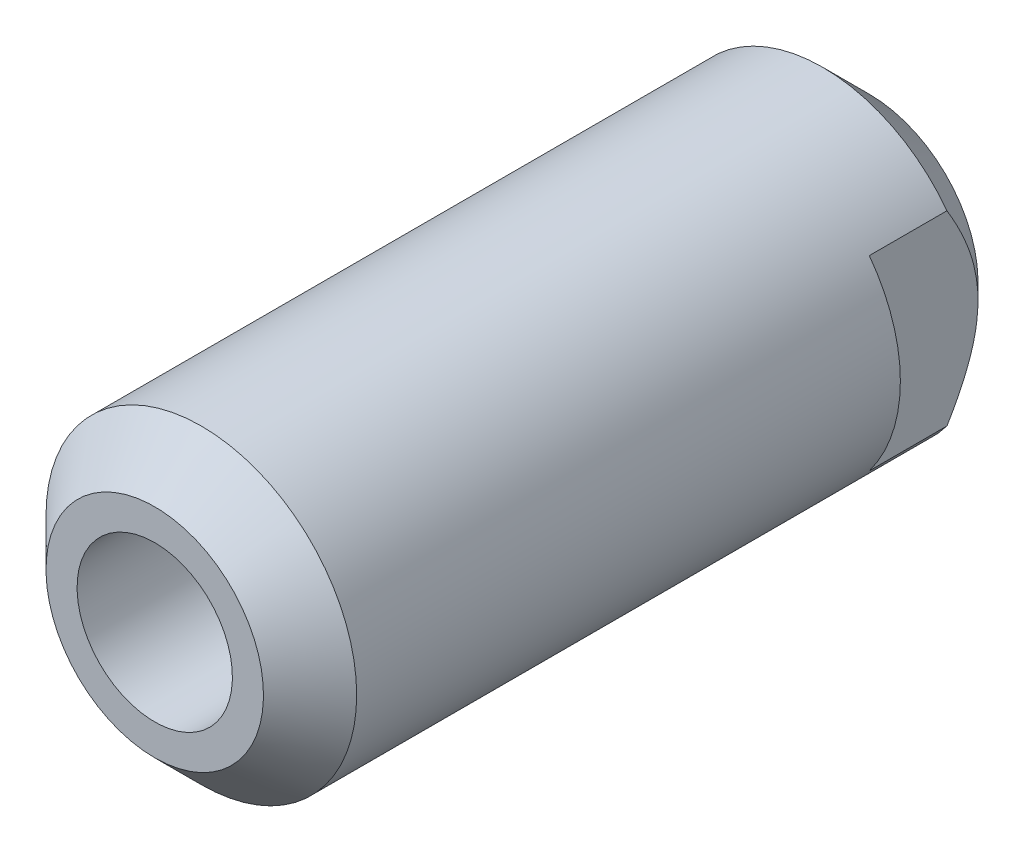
ISO-10303-21;
HEADER;
FILE_DESCRIPTION(('STEP AP214'),'2;1');
FILE_NAME('part.step','',(''),(''),'','','');
FILE_SCHEMA(('AUTOMOTIVE_DESIGN { 1 0 10303 214 1 1 1 1 }'));
ENDSEC;
DATA;
#1=APPLICATION_CONTEXT('core data for automotive mechanical design processes');
#2=APPLICATION_PROTOCOL_DEFINITION('international standard','automotive_design',2000,#1);
#3=PRODUCT_CONTEXT('',#1,'mechanical');
#4=PRODUCT('Part','Part','',(#3));
#5=PRODUCT_RELATED_PRODUCT_CATEGORY('part','',(#4));
#6=PRODUCT_DEFINITION_FORMATION('','',#4);
#7=PRODUCT_DEFINITION_CONTEXT('part definition',#1,'design');
#8=PRODUCT_DEFINITION('design','',#6,#7);
#9=PRODUCT_DEFINITION_SHAPE('','',#8);
#10=(LENGTH_UNIT() NAMED_UNIT(*) SI_UNIT(.MILLI.,.METRE.));
#11=(NAMED_UNIT(*) PLANE_ANGLE_UNIT() SI_UNIT($,.RADIAN.));
#12=(NAMED_UNIT(*) SI_UNIT($,.STERADIAN.) SOLID_ANGLE_UNIT());
#13=UNCERTAINTY_MEASURE_WITH_UNIT(LENGTH_MEASURE(1.E-05),#10,'distance_accuracy_value','');
#14=(GEOMETRIC_REPRESENTATION_CONTEXT(3) GLOBAL_UNCERTAINTY_ASSIGNED_CONTEXT((#13)) GLOBAL_UNIT_ASSIGNED_CONTEXT((#10,
#11,#12)) REPRESENTATION_CONTEXT('',''));
#15=CARTESIAN_POINT('',(0.,0.,0.));
#16=DIRECTION('',(0.,0.,1.));
#17=DIRECTION('',(1.,0.,0.));
#18=AXIS2_PLACEMENT_3D('',#15,#16,#17);
#19=CARTESIAN_POINT('',(-4.00000000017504,-3.03599999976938,4.));
#20=DIRECTION('',(0.,0.,1.));
#21=DIRECTION('',(5.76549803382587E-11,1.,0.));
#22=AXIS2_PLACEMENT_3D('',#19,#20,#21);
#23=PLANE('',#22);
#24=DIRECTION('',(-5.76549803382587E-11,-1.,0.));
#25=VECTOR('',#24,1.);
#26=CARTESIAN_POINT('',(-4.,2.30619921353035E-10,4.));
#27=LINE('',#26,#25);
#28=CARTESIAN_POINT('',(-3.99999999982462,3.00000000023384,4.));
#29=VERTEX_POINT('',#28);
#30=CARTESIAN_POINT('',(-3.99999999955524,-3.00000000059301,4.));
#31=VERTEX_POINT('',#30);
#32=EDGE_CURVE('E54',#29,#31,#27,.T.);
#33=ORIENTED_EDGE('',*,*,#32,.T.);
#34=CARTESIAN_POINT('',(0.,0.,4.));
#35=DIRECTION('',(0.,0.,1.));
#36=DIRECTION('',(-1.,5.76549803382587E-11,0.));
#37=AXIS2_PLACEMENT_3D('',#34,#35,#36);
#38=CIRCLE('',#37,5.);
#39=EDGE_CURVE('E18',#29,#31,#38,.T.);
#40=ORIENTED_EDGE('',*,*,#39,.F.);
#41=EDGE_LOOP('',(#33,#40));
#42=FACE_BOUND('',#41,.T.);
#43=ADVANCED_FACE('F14',(#42),#23,.F.);
#44=CARTESIAN_POINT('',(5.04836367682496,-3.03600000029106,4.));
#45=DIRECTION('',(0.,0.,1.));
#46=DIRECTION('',(5.76549803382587E-11,1.,0.));
#47=AXIS2_PLACEMENT_3D('',#44,#45,#46);
#48=PLANE('',#47);
#49=DIRECTION('',(5.76549803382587E-11,1.,0.));
#50=VECTOR('',#49,1.);
#51=CARTESIAN_POINT('',(4.,-2.30619921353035E-10,4.));
#52=LINE('',#51,#50);
#53=CARTESIAN_POINT('',(4.00000000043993,-2.99999999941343,4.));
#54=VERTEX_POINT('',#53);
#55=CARTESIAN_POINT('',(4.00000000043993,2.99999999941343,4.));
#56=VERTEX_POINT('',#55);
#57=EDGE_CURVE('E71',#54,#56,#52,.T.);
#58=ORIENTED_EDGE('',*,*,#57,.T.);
#59=CARTESIAN_POINT('',(0.,0.,4.));
#60=DIRECTION('',(0.,0.,1.));
#61=DIRECTION('',(-1.,5.76549803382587E-11,0.));
#62=AXIS2_PLACEMENT_3D('',#59,#60,#61);
#63=CIRCLE('',#62,5.);
#64=EDGE_CURVE('E147',#54,#56,#63,.T.);
#65=ORIENTED_EDGE('',*,*,#64,.F.);
#66=EDGE_LOOP('',(#58,#65));
#67=FACE_BOUND('',#66,.T.);
#68=ADVANCED_FACE('F138',(#67),#48,.F.);
#69=CARTESIAN_POINT('',(-4.00000000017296,-2.99999999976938,0.451604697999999));
#70=DIRECTION('',(1.,-5.76549803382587E-11,0.));
#71=DIRECTION('',(5.76549803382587E-11,1.,0.));
#72=AXIS2_PLACEMENT_3D('',#69,#70,#71);
#73=PLANE('',#72);
#74=CARTESIAN_POINT('',(-4.00000000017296,-3.00000000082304,1.5000000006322));
#75=CARTESIAN_POINT('',(-4.00000000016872,-2.92639584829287,1.45584224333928));
#76=CARTESIAN_POINT('',(-4.00000000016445,-2.85233776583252,1.41244232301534));
#77=CARTESIAN_POINT('',(-4.00000000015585,-2.70320881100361,1.32737788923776));
#78=CARTESIAN_POINT('',(-4.00000000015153,-2.6281376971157,1.28571379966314));
#79=CARTESIAN_POINT('',(-4.00000000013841,-2.40073048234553,1.16337968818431));
#80=CARTESIAN_POINT('',(-4.00000000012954,-2.24675491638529,1.08570477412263));
#81=CARTESIAN_POINT('',(-4.00000000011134,-1.93107831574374,0.939497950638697));
#82=CARTESIAN_POINT('',(-4.00000000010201,-1.76928792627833,0.871156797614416));
#83=CARTESIAN_POINT('',(-4.00000000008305,-1.44053681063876,0.748760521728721));
#84=CARTESIAN_POINT('',(-4.00000000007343,-1.2735844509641,0.694683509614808));
#85=CARTESIAN_POINT('',(-4.00000000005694,-0.987583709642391,0.618577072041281));
#86=CARTESIAN_POINT('',(-4.00000000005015,-0.869797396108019,0.591811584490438));
#87=CARTESIAN_POINT('',(-4.00000000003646,-0.632396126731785,0.548003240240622));
#88=CARTESIAN_POINT('',(-4.00000000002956,-0.512781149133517,0.530960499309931));
#89=CARTESIAN_POINT('',(-4.00000000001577,-0.273570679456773,0.507593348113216));
#90=CARTESIAN_POINT('',(-4.00000000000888,-0.153984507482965,0.501174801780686));
#91=CARTESIAN_POINT('',(-3.99999999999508,0.0852774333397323,0.499120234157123));
#92=CARTESIAN_POINT('',(-3.99999999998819,0.204953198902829,0.503483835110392));
#93=CARTESIAN_POINT('',(-3.99999999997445,0.443220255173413,0.522731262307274));
#94=CARTESIAN_POINT('',(-3.99999999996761,0.561813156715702,0.537595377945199));
#95=CARTESIAN_POINT('',(-3.99999999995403,0.79734505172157,0.577040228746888));
#96=CARTESIAN_POINT('',(-3.99999999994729,0.914283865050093,0.601622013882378));
#97=CARTESIAN_POINT('',(-3.99999999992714,1.26369629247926,0.68877334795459));
#98=CARTESIAN_POINT('',(-3.99999999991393,1.49292300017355,0.76457165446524));
#99=CARTESIAN_POINT('',(-3.99999999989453,1.82934366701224,0.897244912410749));
#100=CARTESIAN_POINT('',(-3.99999999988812,1.94049628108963,0.944764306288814));
#101=CARTESIAN_POINT('',(-3.99999999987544,2.16043613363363,1.04509924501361));
#102=CARTESIAN_POINT('',(-3.99999999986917,2.26922294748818,1.09791573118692));
#103=CARTESIAN_POINT('',(-3.99999999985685,2.48281501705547,1.2070218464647));
#104=CARTESIAN_POINT('',(-3.99999999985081,2.58765615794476,1.26324207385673));
#105=CARTESIAN_POINT('',(-3.99999999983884,2.79528919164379,1.37916947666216));
#106=CARTESIAN_POINT('',(-3.99999999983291,2.89808262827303,1.4388738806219));
#107=CARTESIAN_POINT('',(-3.99999999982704,3.0000000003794,1.50000000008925));
#108=B_SPLINE_CURVE_WITH_KNOTS('',3,(#74,#75,#76,#77,#78,#79,#80,#81,#82,#83,#84,#85,#86,#87,
#88,#89,#90,#91,#92,#93,#94,#95,#96,#97,#98,#99,#100,#101,#102,#103,#104,#105,#106,#107),
.UNSPECIFIED.,.F.,.F.,(4,2,2,2,2,2,2,2,2,2,2,2,2,2,2,2,4),(0.,0.257493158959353,
0.515048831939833,1.03210439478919,1.55851091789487,2.08410487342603,2.4461226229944,
2.80814468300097,3.16694151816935,3.52572578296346,3.88383835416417,4.24198962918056,
4.96378621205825,5.326369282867,5.68901690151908,6.04584037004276,6.40238377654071),.UNSPECIFIED.);
#109=CARTESIAN_POINT('',(-3.99999999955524,-3.00000000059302,1.5));
#110=VERTEX_POINT('',#109);
#111=CARTESIAN_POINT('',(-3.99999999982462,3.00000000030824,1.5000000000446));
#112=VERTEX_POINT('',#111);
#113=EDGE_CURVE('E70',#110,#112,#108,.T.);
#114=ORIENTED_EDGE('',*,*,#113,.F.);
#115=DIRECTION('',(0.,0.,-1.));
#116=VECTOR('',#115,1.);
#117=CARTESIAN_POINT('',(-3.99999999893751,-3.00000000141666,11.5));
#118=LINE('',#117,#116);
#119=EDGE_CURVE('E63',#31,#110,#118,.T.);
#120=ORIENTED_EDGE('',*,*,#119,.F.);
#121=ORIENTED_EDGE('',*,*,#32,.F.);
#122=DIRECTION('',(0.,0.,1.));
#123=VECTOR('',#122,1.);
#124=CARTESIAN_POINT('',(-3.9999999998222,3.00000000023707,11.5));
#125=LINE('',#124,#123);
#126=EDGE_CURVE('E65',#112,#29,#125,.T.);
#127=ORIENTED_EDGE('',*,*,#126,.F.);
#128=EDGE_LOOP('',(#114,#120,#121,#127));
#129=FACE_BOUND('',#128,.T.);
#130=ADVANCED_FACE('F68',(#129),#73,.F.);
#131=CARTESIAN_POINT('',(4.00000000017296,2.99999999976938,0.451604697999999));
#132=DIRECTION('',(-1.,5.76549803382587E-11,0.));
#133=DIRECTION('',(-5.76549803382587E-11,-1.,0.));
#134=AXIS2_PLACEMENT_3D('',#131,#132,#133);
#135=PLANE('',#134);
#136=CARTESIAN_POINT('',(4.00000000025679,2.99999999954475,1.49999999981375));
#137=CARTESIAN_POINT('',(4.00000000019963,2.92639584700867,1.45584224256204));
#138=CARTESIAN_POINT('',(4.00000000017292,2.85233776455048,1.41244232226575));
#139=CARTESIAN_POINT('',(4.00000000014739,2.70320880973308,1.32737788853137));
#140=CARTESIAN_POINT('',(4.00000000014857,2.62813769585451,1.28571379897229));
#141=CARTESIAN_POINT('',(4.00000000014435,2.40073048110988,1.16337968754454));
#142=CARTESIAN_POINT('',(4.00000000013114,2.24675491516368,1.08570477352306));
#143=CARTESIAN_POINT('',(4.0000000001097,1.93107831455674,0.939497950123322));
#144=CARTESIAN_POINT('',(4.00000000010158,1.76928792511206,0.871156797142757));
#145=CARTESIAN_POINT('',(4.00000000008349,1.44053680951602,0.748760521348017));
#146=CARTESIAN_POINT('',(4.00000000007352,1.27358444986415,0.694683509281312));
#147=CARTESIAN_POINT('',(4.00000000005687,0.987583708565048,0.618577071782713));
#148=CARTESIAN_POINT('',(4.00000000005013,0.869797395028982,0.591811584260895));
#149=CARTESIAN_POINT('',(4.00000000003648,0.63239612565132,0.548003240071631));
#150=CARTESIAN_POINT('',(4.00000000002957,0.512781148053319,0.530960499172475));
#151=CARTESIAN_POINT('',(4.00000000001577,0.273570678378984,0.507593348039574));
#152=CARTESIAN_POINT('',(4.00000000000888,0.153984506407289,0.50117480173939));
#153=CARTESIAN_POINT('',(3.99999999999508,-0.0852774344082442,0.499120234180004));
#154=CARTESIAN_POINT('',(3.99999999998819,-0.204953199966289,0.503483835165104));
#155=CARTESIAN_POINT('',(3.99999999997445,-0.443220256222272,0.522731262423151));
#156=CARTESIAN_POINT('',(3.99999999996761,-0.561813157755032,0.537595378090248));
#157=CARTESIAN_POINT('',(3.99999999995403,-0.797345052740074,0.577040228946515));
#158=CARTESIAN_POINT('',(3.99999999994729,-0.914283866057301,0.60162201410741));
#159=CARTESIAN_POINT('',(3.99999999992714,-1.26369629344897,0.688773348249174));
#160=CARTESIAN_POINT('',(3.99999999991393,-1.49292300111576,0.76457165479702));
#161=CARTESIAN_POINT('',(3.99999999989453,-1.82934366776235,0.897244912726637));
#162=CARTESIAN_POINT('',(3.99999999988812,-1.94049628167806,0.944764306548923));
#163=CARTESIAN_POINT('',(3.99999999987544,-2.16043613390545,1.04509924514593));
#164=CARTESIAN_POINT('',(3.99999999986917,-2.26922294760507,1.09791573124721));
#165=CARTESIAN_POINT('',(3.99999999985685,-2.48281501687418,1.20702184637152));
#166=CARTESIAN_POINT('',(3.99999999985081,-2.58765615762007,1.2632420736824));
#167=CARTESIAN_POINT('',(3.99999999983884,-2.79528919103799,1.37916947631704));
#168=CARTESIAN_POINT('',(3.99999999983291,-2.89808262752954,1.43887388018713));
#169=CARTESIAN_POINT('',(3.99999999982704,-2.99999999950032,1.4999999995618));
#170=B_SPLINE_CURVE_WITH_KNOTS('',3,(#136,#137,#138,#139,#140,#141,#142,#143,#144,#145,#146,
#147,#148,#149,#150,#151,#152,#153,#154,#155,#156,#157,#158,#159,#160,#161,#162,#163,#164,#165,
#166,#167,#168,#169),.UNSPECIFIED.,.F.,.F.,(4,2,2,2,2,2,2,2,2,2,2,2,2,2,2,2,4),(0.,
0.257493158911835,0.515048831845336,1.03210439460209,1.55851091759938,2.08410487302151,
2.44612262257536,2.80814468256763,3.16694151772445,3.525725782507,3.88383835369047,
4.24198962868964,4.96378621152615,5.32636928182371,5.68901689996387,6.04584036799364,
6.40238377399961),.UNSPECIFIED.);
#171=CARTESIAN_POINT('',(4.00000000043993,2.99999999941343,1.5));
#172=VERTEX_POINT('',#171);
#173=CARTESIAN_POINT('',(4.00000000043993,-2.9999999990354,1.49999999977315));
#174=VERTEX_POINT('',#173);
#175=EDGE_CURVE('E33',#172,#174,#170,.T.);
#176=ORIENTED_EDGE('',*,*,#175,.F.);
#177=DIRECTION('',(0.,0.,-1.));
#178=VECTOR('',#177,1.);
#179=CARTESIAN_POINT('',(4.00000000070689,2.99999999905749,11.5));
#180=LINE('',#179,#178);
#181=EDGE_CURVE('E81',#56,#172,#180,.T.);
#182=ORIENTED_EDGE('',*,*,#181,.F.);
#183=ORIENTED_EDGE('',*,*,#57,.F.);
#184=DIRECTION('',(0.,0.,1.));
#185=VECTOR('',#184,1.);
#186=CARTESIAN_POINT('',(4.00000000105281,-2.99999999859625,11.5));
#187=LINE('',#186,#185);
#188=EDGE_CURVE('E74',#174,#54,#187,.T.);
#189=ORIENTED_EDGE('',*,*,#188,.F.);
#190=EDGE_LOOP('',(#176,#182,#183,#189));
#191=FACE_BOUND('',#190,.T.);
#192=ADVANCED_FACE('F109',(#191),#135,.F.);
#193=CARTESIAN_POINT('',(0.,0.,1.5));
#194=DIRECTION('',(0.,0.,1.));
#195=DIRECTION('',(-1.,5.76549803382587E-11,0.));
#196=AXIS2_PLACEMENT_3D('',#193,#194,#195);
#197=CYLINDRICAL_SURFACE('',#196,5.);
#198=ORIENTED_EDGE('',*,*,#119,.T.);
#199=CARTESIAN_POINT('',(0.,0.,1.5));
#200=DIRECTION('',(0.,0.,1.));
#201=DIRECTION('',(5.76549803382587E-11,1.,0.));
#202=AXIS2_PLACEMENT_3D('',#199,#200,#201);
#203=CIRCLE('',#202,5.);
#204=EDGE_CURVE('E91',#174,#110,#203,.F.);
#205=ORIENTED_EDGE('',*,*,#204,.F.);
#206=ORIENTED_EDGE('',*,*,#188,.T.);
#207=ORIENTED_EDGE('',*,*,#64,.T.);
#208=ORIENTED_EDGE('',*,*,#181,.T.);
#209=CARTESIAN_POINT('',(0.,0.,1.5));
#210=DIRECTION('',(0.,0.,1.));
#211=DIRECTION('',(5.76549803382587E-11,1.,0.));
#212=AXIS2_PLACEMENT_3D('',#209,#210,#211);
#213=CIRCLE('',#212,5.);
#214=EDGE_CURVE('E99',#112,#172,#213,.F.);
#215=ORIENTED_EDGE('',*,*,#214,.F.);
#216=ORIENTED_EDGE('',*,*,#126,.T.);
#217=ORIENTED_EDGE('',*,*,#39,.T.);
#218=EDGE_LOOP('',(#198,#205,#206,#207,#208,#215,#216,#217));
#219=FACE_BOUND('',#218,.T.);
#220=CARTESIAN_POINT('',(0.,0.,21.5));
#221=DIRECTION('',(0.,0.,-1.));
#222=DIRECTION('',(-5.76549803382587E-11,-1.,0.));
#223=AXIS2_PLACEMENT_3D('',#220,#221,#222);
#224=CIRCLE('',#223,5.);
#225=CARTESIAN_POINT('',(-2.88274901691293E-10,-5.,21.5000000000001));
#226=VERTEX_POINT('',#225);
#227=EDGE_CURVE('E79',#226,#226,#224,.F.);
#228=ORIENTED_EDGE('',*,*,#227,.F.);
#229=EDGE_LOOP('',(#228));
#230=FACE_BOUND('',#229,.T.);
#231=ADVANCED_FACE('F60',(#219,#230),#197,.T.);
#232=CARTESIAN_POINT('',(0.,0.,23.));
#233=DIRECTION('',(0.,0.,-1.));
#234=DIRECTION('',(-5.76549803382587E-11,-1.,0.));
#235=AXIS2_PLACEMENT_3D('',#232,#233,#234);
#236=CONICAL_SURFACE('',#235,3.5,0.785398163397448);
#237=ORIENTED_EDGE('',*,*,#227,.T.);
#238=EDGE_LOOP('',(#237));
#239=FACE_BOUND('',#238,.T.);
#240=CARTESIAN_POINT('',(0.,0.,23.));
#241=DIRECTION('',(0.,0.,-1.));
#242=DIRECTION('',(-5.76549803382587E-11,-1.,0.));
#243=AXIS2_PLACEMENT_3D('',#240,#241,#242);
#244=CIRCLE('',#243,3.5);
#245=CARTESIAN_POINT('',(-2.01792431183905E-10,-3.5,23.));
#246=VERTEX_POINT('',#245);
#247=EDGE_CURVE('E88',#246,#246,#244,.F.);
#248=ORIENTED_EDGE('',*,*,#247,.F.);
#249=EDGE_LOOP('',(#248));
#250=FACE_BOUND('',#249,.T.);
#251=ADVANCED_FACE('F126',(#239,#250),#236,.T.);
#252=CARTESIAN_POINT('',(0.,0.,0.));
#253=DIRECTION('',(0.,0.,1.));
#254=DIRECTION('',(5.76549803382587E-11,1.,0.));
#255=AXIS2_PLACEMENT_3D('',#252,#253,#254);
#256=CONICAL_SURFACE('',#255,3.5,0.785398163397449);
#257=CARTESIAN_POINT('',(0.,0.,0.));
#258=DIRECTION('',(0.,0.,1.));
#259=DIRECTION('',(5.76549803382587E-11,1.,0.));
#260=AXIS2_PLACEMENT_3D('',#257,#258,#259);
#261=CIRCLE('',#260,3.5);
#262=CARTESIAN_POINT('',(2.01792431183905E-10,3.5,0.));
#263=VERTEX_POINT('',#262);
#264=EDGE_CURVE('E85',#263,#263,#261,.F.);
#265=ORIENTED_EDGE('',*,*,#264,.F.);
#266=EDGE_LOOP('',(#265));
#267=FACE_BOUND('',#266,.T.);
#268=ORIENTED_EDGE('',*,*,#175,.T.);
#269=ORIENTED_EDGE('',*,*,#204,.T.);
#270=ORIENTED_EDGE('',*,*,#113,.T.);
#271=ORIENTED_EDGE('',*,*,#214,.T.);
#272=EDGE_LOOP('',(#268,#269,#270,#271));
#273=FACE_BOUND('',#272,.T.);
#274=ADVANCED_FACE('F105',(#267,#273),#256,.T.);
#275=CARTESIAN_POINT('',(3.55418791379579,-3.54200000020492,23.));
#276=DIRECTION('',(0.,0.,1.));
#277=DIRECTION('',(5.76549803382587E-11,1.,0.));
#278=AXIS2_PLACEMENT_3D('',#275,#276,#277);
#279=PLANE('',#278);
#280=CARTESIAN_POINT('',(0.,0.,23.));
#281=DIRECTION('',(0.,0.,1.));
#282=DIRECTION('',(5.76549803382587E-11,1.,0.));
#283=AXIS2_PLACEMENT_3D('',#280,#281,#282);
#284=CIRCLE('',#283,2.5);
#285=CARTESIAN_POINT('',(1.44137450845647E-10,2.5,23.));
#286=VERTEX_POINT('',#285);
#287=EDGE_CURVE('E24',#286,#286,#284,.F.);
#288=ORIENTED_EDGE('',*,*,#287,.T.);
#289=EDGE_LOOP('',(#288));
#290=FACE_BOUND('',#289,.T.);
#291=ORIENTED_EDGE('',*,*,#247,.T.);
#292=EDGE_LOOP('',(#291));
#293=FACE_BOUND('',#292,.T.);
#294=ADVANCED_FACE('F115',(#290,#293),#279,.T.);
#295=CARTESIAN_POINT('',(3.55418791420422,3.54199999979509,0.));
#296=DIRECTION('',(0.,0.,-1.));
#297=DIRECTION('',(-5.76549803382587E-11,-1.,0.));
#298=AXIS2_PLACEMENT_3D('',#295,#296,#297);
#299=PLANE('',#298);
#300=CARTESIAN_POINT('',(0.,0.,0.));
#301=DIRECTION('',(0.,0.,1.));
#302=DIRECTION('',(5.76549803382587E-11,1.,0.));
#303=AXIS2_PLACEMENT_3D('',#300,#301,#302);
#304=CIRCLE('',#303,2.5);
#305=CARTESIAN_POINT('',(1.44137450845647E-10,2.5,0.));
#306=VERTEX_POINT('',#305);
#307=EDGE_CURVE('E9',#306,#306,#304,.T.);
#308=ORIENTED_EDGE('',*,*,#307,.T.);
#309=EDGE_LOOP('',(#308));
#310=FACE_BOUND('',#309,.T.);
#311=ORIENTED_EDGE('',*,*,#264,.T.);
#312=EDGE_LOOP('',(#311));
#313=FACE_BOUND('',#312,.T.);
#314=ADVANCED_FACE('F16',(#310,#313),#299,.T.);
#315=CARTESIAN_POINT('',(0.,0.,0.));
#316=DIRECTION('',(0.,0.,1.));
#317=DIRECTION('',(5.76549803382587E-11,1.,0.));
#318=AXIS2_PLACEMENT_3D('',#315,#316,#317);
#319=CYLINDRICAL_SURFACE('',#318,2.5);
#320=ORIENTED_EDGE('',*,*,#287,.F.);
#321=EDGE_LOOP('',(#320));
#322=FACE_BOUND('',#321,.T.);
#323=ORIENTED_EDGE('',*,*,#307,.F.);
#324=EDGE_LOOP('',(#323));
#325=FACE_BOUND('',#324,.T.);
#326=ADVANCED_FACE('F124',(#322,#325),#319,.F.);
#327=CLOSED_SHELL('',(#43,#68,#130,#192,#231,#251,#274,#294,#314,#326));
#328=MANIFOLD_SOLID_BREP('B1',#327);
#329=ADVANCED_BREP_SHAPE_REPRESENTATION('',(#18,#328),#14);
#330=SHAPE_DEFINITION_REPRESENTATION(#9,#329);
ENDSEC;
END-ISO-10303-21;
